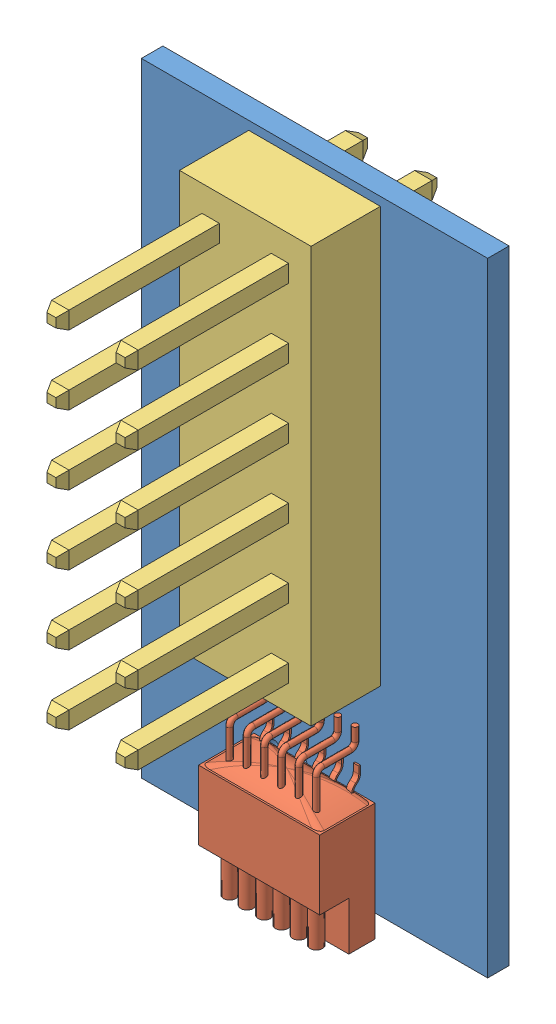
SolidWorks assembly RHD_SPI_Cable_Adapter_socket.SLDASM, configuration Default (file format 15000). Lengths in mm.
Overall size (12.7 23.69 11.43).
3 component instances, 3 part files, 4 mates.
Components (placement in the parent):
- RHD_SPI_Cable_Adapter_PCB-1: RHD_SPI_Cable_Adapter_PCB.SLDPRT [Default] at origin size (12.7 22.86 0.79)
- A79623-001-1: A79623-001.SLDPRT [Default] at (6.35 3.4925 0.7874) x (1 0 0) z (0 -1 0) size (4.45 2.05 6.53)
- ConnHeader_12pos-1: ConnHeader_12pos.SLDPRT [Default] at (6.35 14.9225 0.7874) x (0 -1 0) z (-1 0 0) size (15.24 11.43 4.83)
Mates (geometry in assembly coordinates):
- Coincident1: coincident anti-aligned: plane of rhd2000_cable_adapt2-1 through (0 0 0.7874) normal (0 0 1); plane of A79623-001-1 through (6.35 3.4925 0.7874) normal (0 0 -1)
- Parallel1: parallel aligned: plane of rhd2000_cable_adapt2-1 through (12.7 0 0.7874) normal (0 -1 0); plane of A79623-001-1 through (8.5725 -0.8255 0.7874) normal (0 -1 0)
- Coincident2: coincident anti-aligned: plane of RHD_SPI_Cable_Adapter-1 through (0 0 0.7874) normal (0 0 1); plane of ConnHeader_12pos-1 through (6.35 14.9225 0.7874) normal (0 0 -1)
- Parallel2: parallel aligned: plane of RHD_SPI_Cable_Adapter-1 through (12.7 0 0.7874) normal (0 -1 0); plane of ConnHeader_12pos-1 through (8.763 7.3025 3.3274) normal (0 -1 0)
